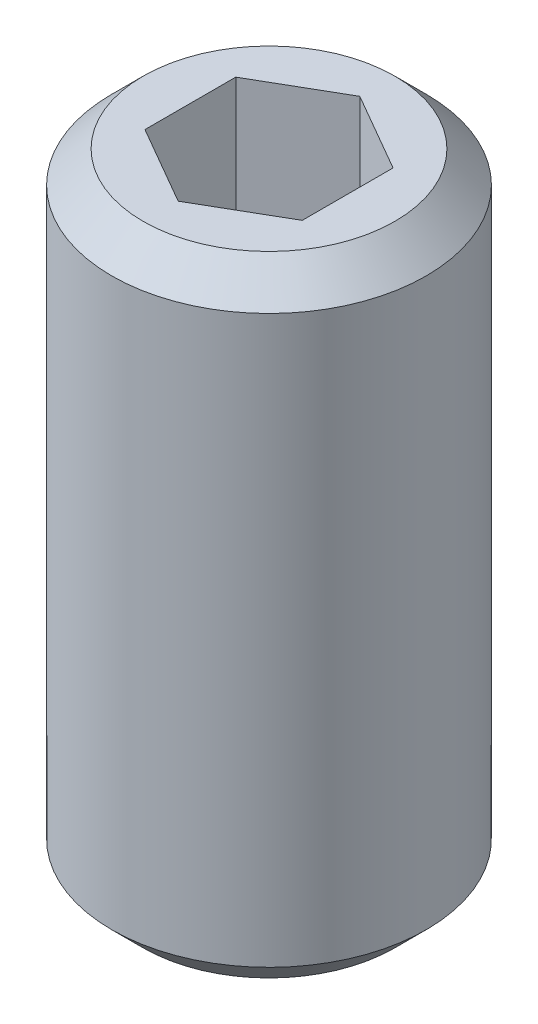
from build123d import *

# Parameters (mm, degrees)
ESQUISSE1_W             = 2.5
ESQUISSE1_H             = 10
CHANFREIN1_SIZE         = 0.5
CHANFREIN2_SIZE         = 0.5
ENL_V_MAT_EXTRU_1_DEPTH = 3.5


with BuildPart() as part:
    # Esquisse1 → Base-R_volution (revolve)
    with BuildSketch(Plane.XY, mode=Mode.PRIVATE) as base_r_volution_sk:
        with Locations((1.25, -5)):
            Rectangle(ESQUISSE1_W, ESQUISSE1_H)
    revolve(base_r_volution_sk.sketch.rotate(Axis((0, 0, 0), (0, -1, 0)), 90), axis=Axis((0, 0, 0), (0, -1, 0)))

    # Chanfrein1
    chanfrein1_edges = [part.edges().sort_by_distance(p)[0] for p in [
        (0, -10, -2.5),
    ]]
    chamfer(chanfrein1_edges, length=CHANFREIN1_SIZE)

    # Chanfrein2
    chanfrein2_edges = [part.edges().sort_by_distance(p)[0] for p in [
        (0, 0, -2.5),
    ]]
    chamfer(chanfrein2_edges, length=CHANFREIN2_SIZE)

    # Esquisse4 → Enl_v. mat.-Extru.1 (cut)
    with BuildSketch(Plane(origin=(0, 0, 0), x_dir=(-1, 0, 0), z_dir=(0, 1, 0))):
        Polygon((0, 1.443375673), (-1.25, 0.721687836), (-1.25, -0.721687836), (0, -1.443375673), (1.25, -0.721687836), (1.25, 0.721687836), align=None)
    extrude(amount=-ENL_V_MAT_EXTRU_1_DEPTH, mode=Mode.SUBTRACT)


solid = part.part
